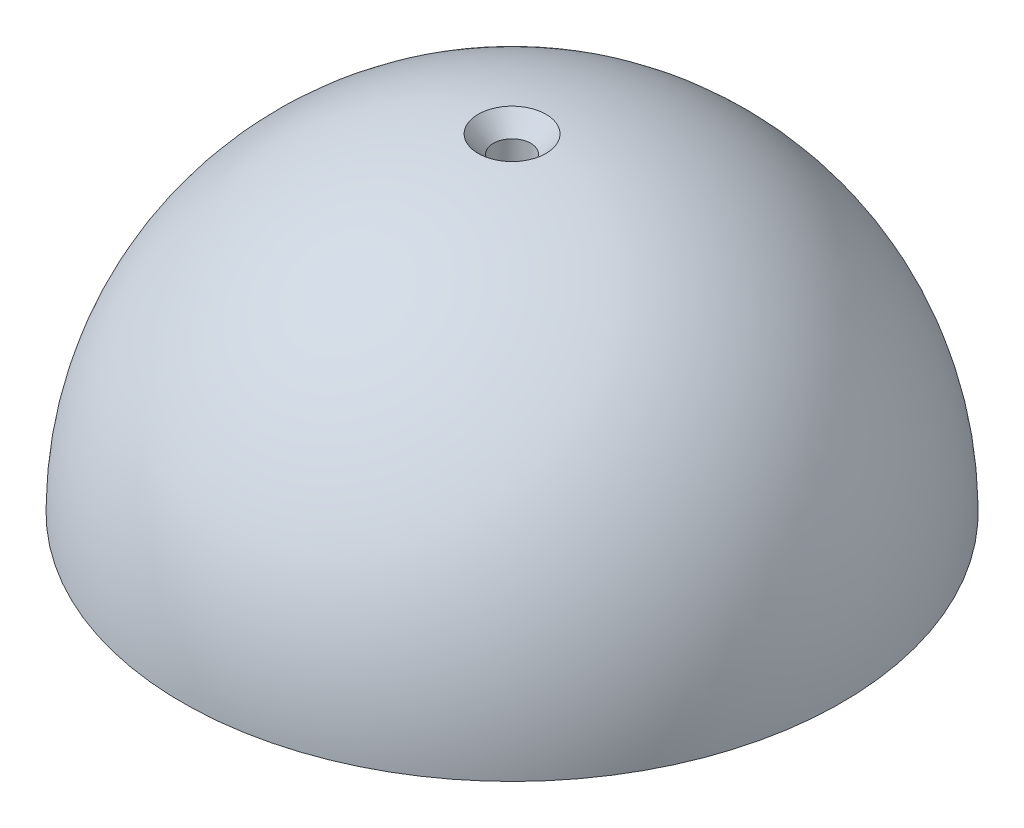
ISO-10303-21;
HEADER;
FILE_DESCRIPTION(('STEP AP214'),'2;1');
FILE_NAME('part.step','',(''),(''),'','','');
FILE_SCHEMA(('AUTOMOTIVE_DESIGN { 1 0 10303 214 1 1 1 1 }'));
ENDSEC;
DATA;
#1=APPLICATION_CONTEXT('core data for automotive mechanical design processes');
#2=APPLICATION_PROTOCOL_DEFINITION('international standard','automotive_design',2000,#1);
#3=PRODUCT_CONTEXT('',#1,'mechanical');
#4=PRODUCT('Part','Part','',(#3));
#5=PRODUCT_RELATED_PRODUCT_CATEGORY('part','',(#4));
#6=PRODUCT_DEFINITION_FORMATION('','',#4);
#7=PRODUCT_DEFINITION_CONTEXT('part definition',#1,'design');
#8=PRODUCT_DEFINITION('design','',#6,#7);
#9=PRODUCT_DEFINITION_SHAPE('','',#8);
#10=(LENGTH_UNIT() NAMED_UNIT(*) SI_UNIT(.MILLI.,.METRE.));
#11=(NAMED_UNIT(*) PLANE_ANGLE_UNIT() SI_UNIT($,.RADIAN.));
#12=(NAMED_UNIT(*) SI_UNIT($,.STERADIAN.) SOLID_ANGLE_UNIT());
#13=UNCERTAINTY_MEASURE_WITH_UNIT(LENGTH_MEASURE(1.E-05),#10,'distance_accuracy_value','');
#14=(GEOMETRIC_REPRESENTATION_CONTEXT(3) GLOBAL_UNCERTAINTY_ASSIGNED_CONTEXT((#13)) GLOBAL_UNIT_ASSIGNED_CONTEXT((#10,
#11,#12)) REPRESENTATION_CONTEXT('',''));
#15=CARTESIAN_POINT('',(0.,0.,0.));
#16=DIRECTION('',(0.,0.,1.));
#17=DIRECTION('',(1.,0.,0.));
#18=AXIS2_PLACEMENT_3D('',#15,#16,#17);
#19=CARTESIAN_POINT('',(0.,0.,0.));
#20=DIRECTION('',(0.,-1.,0.));
#21=DIRECTION('',(1.,0.,0.));
#22=AXIS2_PLACEMENT_3D('',#19,#20,#21);
#23=SPHERICAL_SURFACE('',#22,55.88);
#24=CARTESIAN_POINT('',(0.,55.5828454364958,0.));
#25=DIRECTION('',(0.,-1.,0.));
#26=DIRECTION('',(0.,0.,-1.));
#27=AXIS2_PLACEMENT_3D('',#24,#25,#26);
#28=CIRCLE('',#27,5.75514493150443);
#29=CARTESIAN_POINT('',(0.,55.5828454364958,-5.75514493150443));
#30=VERTEX_POINT('',#29);
#31=EDGE_CURVE('E48',#30,#30,#28,.T.);
#32=ORIENTED_EDGE('',*,*,#31,.T.);
#33=EDGE_LOOP('',(#32));
#34=FACE_BOUND('',#33,.T.);
#35=CARTESIAN_POINT('',(0.,0.,0.));
#36=DIRECTION('',(0.,-1.,0.));
#37=DIRECTION('',(0.,0.,-1.));
#38=AXIS2_PLACEMENT_3D('',#35,#36,#37);
#39=CIRCLE('',#38,55.88);
#40=CARTESIAN_POINT('',(0.,0.,-55.88));
#41=VERTEX_POINT('',#40);
#42=EDGE_CURVE('E53',#41,#41,#39,.T.);
#43=ORIENTED_EDGE('',*,*,#42,.F.);
#44=EDGE_LOOP('',(#43));
#45=FACE_BOUND('',#44,.T.);
#46=ADVANCED_FACE('F39',(#34,#45),#23,.T.);
#47=CARTESIAN_POINT('',(0.,0.,0.));
#48=DIRECTION('',(0.,-1.,0.));
#49=DIRECTION('',(0.,0.,-1.));
#50=AXIS2_PLACEMENT_3D('',#47,#48,#49);
#51=PLANE('',#50);
#52=CARTESIAN_POINT('',(0.,0.,0.));
#53=DIRECTION('',(0.,1.,0.));
#54=DIRECTION('',(0.,0.,1.));
#55=AXIS2_PLACEMENT_3D('',#52,#53,#54);
#56=CIRCLE('',#55,3.175);
#57=CARTESIAN_POINT('',(0.,0.,-3.175));
#58=VERTEX_POINT('',#57);
#59=EDGE_CURVE('E58',#58,#58,#56,.T.);
#60=ORIENTED_EDGE('',*,*,#59,.T.);
#61=EDGE_LOOP('',(#60));
#62=FACE_BOUND('',#61,.T.);
#63=ORIENTED_EDGE('',*,*,#42,.T.);
#64=EDGE_LOOP('',(#63));
#65=FACE_BOUND('',#64,.T.);
#66=ADVANCED_FACE('F65',(#62,#65),#51,.T.);
#67=CARTESIAN_POINT('',(0.,55.88,0.));
#68=DIRECTION('',(0.,-1.,0.));
#69=DIRECTION('',(0.,0.,-1.));
#70=AXIS2_PLACEMENT_3D('',#67,#68,#69);
#71=CYLINDRICAL_SURFACE('',#70,3.175);
#72=CARTESIAN_POINT('',(0.,52.6147282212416,0.));
#73=DIRECTION('',(0.,1.,0.));
#74=DIRECTION('',(0.,0.,1.));
#75=AXIS2_PLACEMENT_3D('',#72,#73,#74);
#76=CIRCLE('',#75,3.175);
#77=CARTESIAN_POINT('',(0.,52.6147282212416,-3.175));
#78=VERTEX_POINT('',#77);
#79=EDGE_CURVE('E10',#78,#78,#76,.T.);
#80=CARTESIAN_POINT('',(0.,52.6147282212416,-3.175));
#81=CARTESIAN_POINT('',(0.,52.0666581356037,-3.175));
#82=CARTESIAN_POINT('',(0.,51.5185880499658,-3.175));
#83=CARTESIAN_POINT('',(0.,50.4224478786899,-3.175));
#84=CARTESIAN_POINT('',(0.,49.874377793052,-3.175));
#85=CARTESIAN_POINT('',(0.,48.7782376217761,-3.175));
#86=CARTESIAN_POINT('',(0.,48.2301675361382,-3.175));
#87=CARTESIAN_POINT('',(0.,47.1340273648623,-3.175));
#88=CARTESIAN_POINT('',(0.,46.5859572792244,-3.175));
#89=CARTESIAN_POINT('',(0.,45.4898171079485,-3.175));
#90=CARTESIAN_POINT('',(0.,44.9417470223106,-3.175));
#91=CARTESIAN_POINT('',(0.,43.8456068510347,-3.175));
#92=CARTESIAN_POINT('',(0.,43.2975367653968,-3.175));
#93=CARTESIAN_POINT('',(0.,42.2013965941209,-3.175));
#94=CARTESIAN_POINT('',(0.,41.653326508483,-3.175));
#95=CARTESIAN_POINT('',(0.,40.5571863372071,-3.175));
#96=CARTESIAN_POINT('',(0.,40.0091162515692,-3.175));
#97=CARTESIAN_POINT('',(0.,38.9129760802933,-3.175));
#98=CARTESIAN_POINT('',(0.,38.3649059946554,-3.175));
#99=CARTESIAN_POINT('',(0.,37.2687658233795,-3.175));
#100=CARTESIAN_POINT('',(0.,36.7206957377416,-3.175));
#101=CARTESIAN_POINT('',(0.,35.6245555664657,-3.175));
#102=CARTESIAN_POINT('',(0.,35.0764854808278,-3.175));
#103=CARTESIAN_POINT('',(0.,33.9803453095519,-3.175));
#104=CARTESIAN_POINT('',(0.,33.432275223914,-3.175));
#105=CARTESIAN_POINT('',(0.,32.3361350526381,-3.175));
#106=CARTESIAN_POINT('',(0.,31.7880649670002,-3.175));
#107=CARTESIAN_POINT('',(0.,30.6919247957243,-3.175));
#108=CARTESIAN_POINT('',(0.,30.1438547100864,-3.175));
#109=CARTESIAN_POINT('',(0.,29.0477145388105,-3.175));
#110=CARTESIAN_POINT('',(0.,28.4996444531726,-3.175));
#111=CARTESIAN_POINT('',(0.,27.4035042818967,-3.175));
#112=CARTESIAN_POINT('',(0.,26.8554341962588,-3.175));
#113=CARTESIAN_POINT('',(0.,25.7592940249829,-3.175));
#114=CARTESIAN_POINT('',(0.,25.211223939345,-3.175));
#115=CARTESIAN_POINT('',(0.,24.1150837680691,-3.175));
#116=CARTESIAN_POINT('',(0.,23.5670136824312,-3.175));
#117=CARTESIAN_POINT('',(0.,22.4708735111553,-3.175));
#118=CARTESIAN_POINT('',(0.,21.9228034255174,-3.175));
#119=CARTESIAN_POINT('',(0.,20.8266632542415,-3.175));
#120=CARTESIAN_POINT('',(0.,20.2785931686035,-3.175));
#121=CARTESIAN_POINT('',(0.,19.1824529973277,-3.175));
#122=CARTESIAN_POINT('',(0.,18.6343829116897,-3.175));
#123=CARTESIAN_POINT('',(0.,17.5382427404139,-3.175));
#124=CARTESIAN_POINT('',(0.,16.9901726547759,-3.175));
#125=CARTESIAN_POINT('',(0.,15.8940324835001,-3.175));
#126=CARTESIAN_POINT('',(0.,15.3459623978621,-3.175));
#127=CARTESIAN_POINT('',(0.,14.2498222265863,-3.175));
#128=CARTESIAN_POINT('',(0.,13.7017521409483,-3.175));
#129=CARTESIAN_POINT('',(0.,12.6056119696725,-3.175));
#130=CARTESIAN_POINT('',(0.,12.0575418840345,-3.175));
#131=CARTESIAN_POINT('',(0.,10.9614017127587,-3.175));
#132=CARTESIAN_POINT('',(0.,10.4133316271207,-3.175));
#133=CARTESIAN_POINT('',(0.,9.31719145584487,-3.175));
#134=CARTESIAN_POINT('',(0.,8.76912137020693,-3.175));
#135=CARTESIAN_POINT('',(0.,7.67298119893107,-3.175));
#136=CARTESIAN_POINT('',(0.,7.12491111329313,-3.175));
#137=CARTESIAN_POINT('',(0.,6.02877094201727,-3.175));
#138=CARTESIAN_POINT('',(0.,5.48070085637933,-3.175));
#139=CARTESIAN_POINT('',(0.,4.38456068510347,-3.175));
#140=CARTESIAN_POINT('',(0.,3.83649059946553,-3.175));
#141=CARTESIAN_POINT('',(0.,2.74035042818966,-3.175));
#142=CARTESIAN_POINT('',(0.,2.19228034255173,-3.175));
#143=CARTESIAN_POINT('',(0.,1.09614017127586,-3.175));
#144=CARTESIAN_POINT('',(0.,0.548070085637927,-3.175));
#145=CARTESIAN_POINT('',(0.,0.,-3.175));
#146=B_SPLINE_CURVE_WITH_KNOTS('',3,(#80,#81,#82,#83,#84,#85,#86,#87,#88,#89,#90,#91,#92,#93,
#94,#95,#96,#97,#98,#99,#100,#101,#102,#103,#104,#105,#106,#107,#108,#109,#110,#111,#112,#113,
#114,#115,#116,#117,#118,#119,#120,#121,#122,#123,#124,#125,#126,#127,#128,#129,#130,#131,#132,
#133,#134,#135,#136,#137,#138,#139,#140,#141,#142,#143,#144,#145),.UNSPECIFIED.,.F.,.F.,(4,2,2,
2,2,2,2,2,2,2,2,2,2,2,2,2,2,2,2,2,2,2,2,2,2,2,2,2,2,2,2,2,4),(0.,1.6442102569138,
3.2884205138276,4.9326307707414,6.5768410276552,8.22105128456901,9.8652615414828,
11.5094717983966,13.1536820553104,14.7978923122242,16.442102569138,18.0863128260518,
19.7305230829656,21.3747333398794,23.0189435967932,24.663153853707,26.3073641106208,
27.9515743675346,29.5957846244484,31.2399948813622,32.884205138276,34.5284153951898,
36.1726256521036,37.8168359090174,39.4610461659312,41.105256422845,42.7494666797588,
44.3936769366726,46.0378871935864,47.6820974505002,49.326307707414,50.9705179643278,
52.6147282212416),.UNSPECIFIED.);
#147=EDGE_CURVE('BSEAM68',#78,#58,#146,.T.);
#148=ORIENTED_EDGE('',*,*,#79,.T.);
#149=ORIENTED_EDGE('',*,*,#59,.F.);
#150=ORIENTED_EDGE('',*,*,#147,.T.);
#151=ORIENTED_EDGE('',*,*,#147,.F.);
#152=EDGE_LOOP('',(#148,#150,#149,#151));
#153=FACE_BOUND('',#152,.T.);
#154=ADVANCED_FACE('F68',(#153),#71,.F.);
#155=CARTESIAN_POINT('',(0.,55.5828454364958,0.));
#156=DIRECTION('',(0.,1.,0.));
#157=DIRECTION('',(0.,0.,1.));
#158=AXIS2_PLACEMENT_3D('',#155,#156,#157);
#159=CONICAL_SURFACE('',#158,5.75514493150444,0.715584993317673);
#160=ORIENTED_EDGE('',*,*,#79,.F.);
#161=EDGE_LOOP('',(#160));
#162=FACE_BOUND('',#161,.T.);
#163=ORIENTED_EDGE('',*,*,#31,.F.);
#164=EDGE_LOOP('',(#163));
#165=FACE_BOUND('',#164,.T.);
#166=ADVANCED_FACE('F42',(#162,#165),#159,.F.);
#167=CLOSED_SHELL('',(#46,#66,#154,#166));
#168=MANIFOLD_SOLID_BREP('B2',#167);
#169=ADVANCED_BREP_SHAPE_REPRESENTATION('',(#18,#168),#14);
#170=SHAPE_DEFINITION_REPRESENTATION(#9,#169);
ENDSEC;
END-ISO-10303-21;
